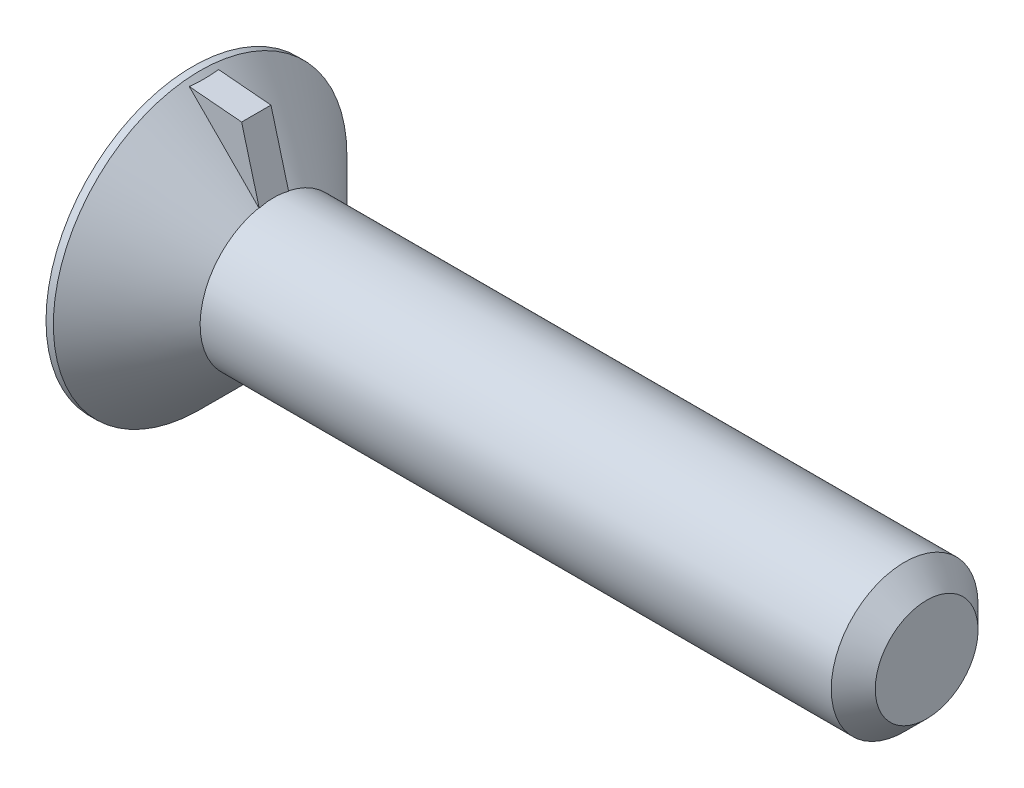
from build123d import *

# Parameters (mm, degrees)
KEY_DEPTH = 1


with BuildPart() as part:
    # BaseBodySke → BaseBody (revolve)
    with BuildSketch(Plane.XY, mode=Mode.PRIVATE) as basebody_sk:
        Polygon((0, 0), (0, 10), (0.5, 10), (5.5, 5), (50, 5), (50, 0), align=None)
    revolve(basebody_sk.sketch.rotate(Axis((50, 0, 0), (-1, 0, 0)), 90), axis=Axis((50, 0, 0), (-1, 0, 0)))

    # FlatEndSke → FlatEnd (revolve, cut)
    with BuildSketch(Plane.XY, mode=Mode.PRIVATE) as flatend_sk:
        Polygon((48.5, 5), (50, 5), (50, 3.5), align=None)
    revolve(flatend_sk.sketch.rotate(Axis((0, 0, 0), (1, 0, 0)), 270), axis=Axis((0, 0, 0), (1, 0, 0)), mode=Mode.SUBTRACT)

    # KeySke → Key (add, symmetric)
    with BuildSketch(Plane.XY):
        Polygon((0, 9.756097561), (0, 0), (6.839745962, 0), (4.327044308, 9.377530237), align=None)
    extrude(amount=KEY_DEPTH, both=True)


solid = part.part
